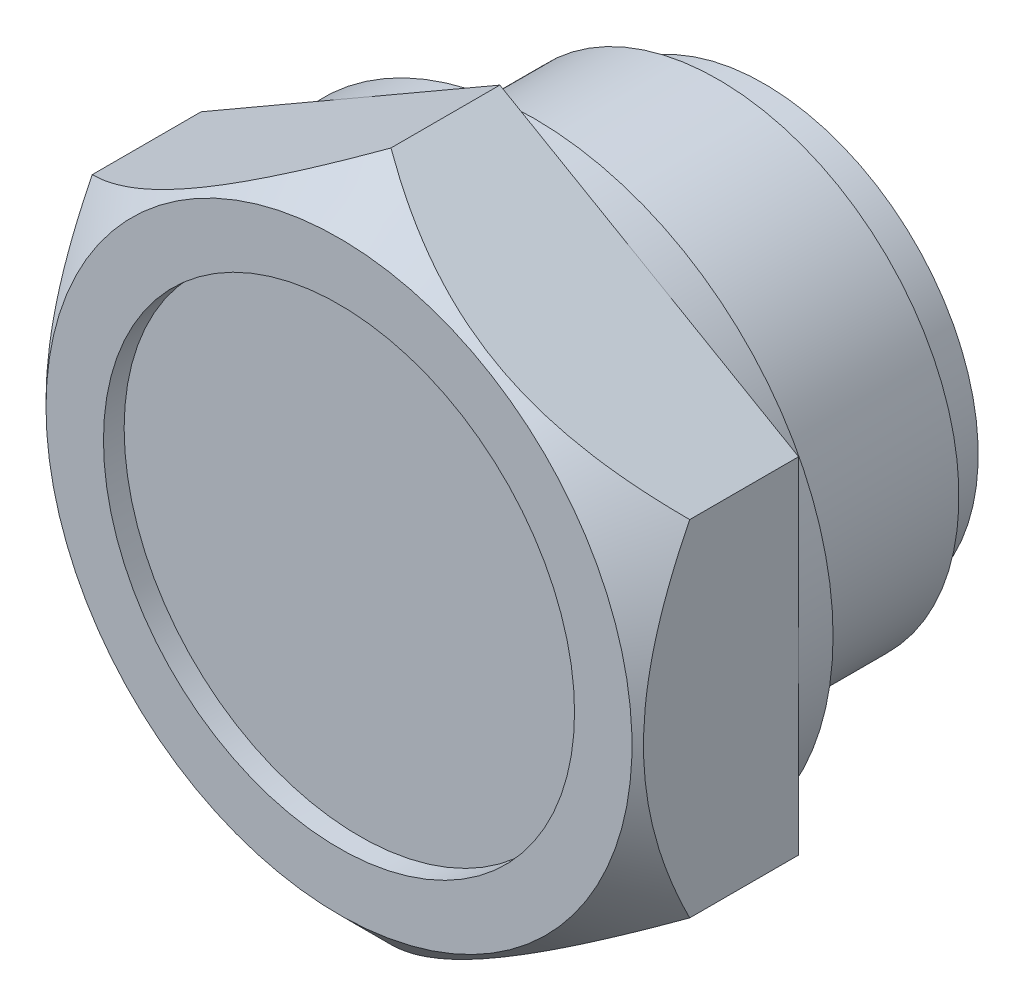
ISO-10303-21;
HEADER;
FILE_DESCRIPTION(('STEP AP214'),'2;1');
FILE_NAME('part.step','',(''),(''),'','','');
FILE_SCHEMA(('AUTOMOTIVE_DESIGN { 1 0 10303 214 1 1 1 1 }'));
ENDSEC;
DATA;
#1=APPLICATION_CONTEXT('core data for automotive mechanical design processes');
#2=APPLICATION_PROTOCOL_DEFINITION('international standard','automotive_design',2000,#1);
#3=PRODUCT_CONTEXT('',#1,'mechanical');
#4=PRODUCT('Part','Part','',(#3));
#5=PRODUCT_RELATED_PRODUCT_CATEGORY('part','',(#4));
#6=PRODUCT_DEFINITION_FORMATION('','',#4);
#7=PRODUCT_DEFINITION_CONTEXT('part definition',#1,'design');
#8=PRODUCT_DEFINITION('design','',#6,#7);
#9=PRODUCT_DEFINITION_SHAPE('','',#8);
#10=(LENGTH_UNIT() NAMED_UNIT(*) SI_UNIT(.MILLI.,.METRE.));
#11=(NAMED_UNIT(*) PLANE_ANGLE_UNIT() SI_UNIT($,.RADIAN.));
#12=(NAMED_UNIT(*) SI_UNIT($,.STERADIAN.) SOLID_ANGLE_UNIT());
#13=UNCERTAINTY_MEASURE_WITH_UNIT(LENGTH_MEASURE(1.E-05),#10,'distance_accuracy_value','');
#14=(GEOMETRIC_REPRESENTATION_CONTEXT(3) GLOBAL_UNCERTAINTY_ASSIGNED_CONTEXT((#13)) GLOBAL_UNIT_ASSIGNED_CONTEXT((#10,
#11,#12)) REPRESENTATION_CONTEXT('',''));
#15=CARTESIAN_POINT('',(0.,0.,0.));
#16=DIRECTION('',(0.,0.,1.));
#17=DIRECTION('',(1.,0.,0.));
#18=AXIS2_PLACEMENT_3D('',#15,#16,#17);
#19=CARTESIAN_POINT('',(0.,13.,1.5));
#20=DIRECTION('',(0.,0.,-1.));
#21=DIRECTION('',(-1.,0.,0.));
#22=AXIS2_PLACEMENT_3D('',#19,#20,#21);
#23=PLANE('',#22);
#24=DIRECTION('',(7.05455965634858E-10,1.,0.));
#25=VECTOR('',#24,1.);
#26=CARTESIAN_POINT('',(13.0000000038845,12.9999999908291,1.5));
#27=LINE('',#26,#25);
#28=CARTESIAN_POINT('',(12.999999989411,-7.5055534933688,1.5));
#29=VERTEX_POINT('',#28);
#30=CARTESIAN_POINT('',(13.,-9.17091402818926E-09,1.5));
#31=VERTEX_POINT('',#30);
#32=EDGE_CURVE('E311',#29,#31,#27,.T.);
#33=ORIENTED_EDGE('',*,*,#32,.F.);
#34=DIRECTION('',(0.866025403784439,0.5,0.));
#35=VECTOR('',#34,1.);
#36=CARTESIAN_POINT('',(12.1291651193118,-8.00833024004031,1.5));
#37=LINE('',#36,#35);
#38=CARTESIAN_POINT('',(6.5,-11.2583302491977,1.5));
#39=VERTEX_POINT('',#38);
#40=EDGE_CURVE('E313',#39,#29,#37,.T.);
#41=ORIENTED_EDGE('',*,*,#40,.F.);
#42=CARTESIAN_POINT('',(0.,0.,1.5));
#43=DIRECTION('',(0.,0.,-1.));
#44=DIRECTION('',(-1.,0.,0.));
#45=AXIS2_PLACEMENT_3D('',#42,#43,#44);
#46=CIRCLE('',#45,13.);
#47=EDGE_CURVE('E319',#31,#39,#46,.T.);
#48=ORIENTED_EDGE('',*,*,#47,.F.);
#49=EDGE_LOOP('',(#33,#41,#48));
#50=FACE_BOUND('',#49,.T.);
#51=ADVANCED_FACE('F14',(#50),#23,.T.);
#52=CARTESIAN_POINT('',(13.0000000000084,7.5055534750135,1.5));
#53=VERTEX_POINT('',#52);
#54=EDGE_CURVE('E310',#31,#53,#27,.T.);
#55=ORIENTED_EDGE('',*,*,#54,.F.);
#56=CARTESIAN_POINT('',(6.5,11.2583302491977,1.5));
#57=VERTEX_POINT('',#56);
#58=EDGE_CURVE('E266',#57,#31,#46,.T.);
#59=ORIENTED_EDGE('',*,*,#58,.F.);
#60=DIRECTION('',(-0.866025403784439,0.5,0.));
#61=VECTOR('',#60,1.);
#62=CARTESIAN_POINT('',(0.870834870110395,14.5083302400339,1.5));
#63=LINE('',#62,#61);
#64=EDGE_CURVE('E200',#53,#57,#63,.T.);
#65=ORIENTED_EDGE('',*,*,#64,.F.);
#66=EDGE_LOOP('',(#55,#59,#65));
#67=FACE_BOUND('',#66,.T.);
#68=ADVANCED_FACE('F236',(#67),#23,.T.);
#69=CARTESIAN_POINT('',(0.,15.0111069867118,1.5));
#70=VERTEX_POINT('',#69);
#71=EDGE_CURVE('E201',#57,#70,#63,.T.);
#72=ORIENTED_EDGE('',*,*,#71,.F.);
#73=CARTESIAN_POINT('',(-6.5,11.2583302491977,1.5));
#74=VERTEX_POINT('',#73);
#75=EDGE_CURVE('E261',#74,#57,#46,.T.);
#76=ORIENTED_EDGE('',*,*,#75,.F.);
#77=DIRECTION('',(-0.866025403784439,-0.5,0.));
#78=VECTOR('',#77,1.);
#79=CARTESIAN_POINT('',(-0.870834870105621,14.5083302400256,1.5));
#80=LINE('',#79,#78);
#81=EDGE_CURVE('E258',#70,#74,#80,.T.);
#82=ORIENTED_EDGE('',*,*,#81,.F.);
#83=EDGE_LOOP('',(#72,#76,#82));
#84=FACE_BOUND('',#83,.T.);
#85=ADVANCED_FACE('F241',(#84),#23,.T.);
#86=CARTESIAN_POINT('',(1.05861500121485E-11,-15.0111069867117,1.5));
#87=VERTEX_POINT('',#86);
#88=EDGE_CURVE('E39',#87,#39,#37,.T.);
#89=ORIENTED_EDGE('',*,*,#88,.F.);
#90=DIRECTION('',(0.866025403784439,-0.5,0.));
#91=VECTOR('',#90,1.);
#92=CARTESIAN_POINT('',(-12.1291651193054,-8.00833024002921,1.5));
#93=LINE('',#92,#91);
#94=CARTESIAN_POINT('',(-6.5,-11.2583302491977,1.5));
#95=VERTEX_POINT('',#94);
#96=EDGE_CURVE('E115',#95,#87,#93,.T.);
#97=ORIENTED_EDGE('',*,*,#96,.F.);
#98=EDGE_CURVE('E320',#39,#95,#46,.T.);
#99=ORIENTED_EDGE('',*,*,#98,.F.);
#100=EDGE_LOOP('',(#89,#97,#99));
#101=FACE_BOUND('',#100,.T.);
#102=ADVANCED_FACE('F248',(#101),#23,.T.);
#103=CARTESIAN_POINT('',(-12.9999999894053,7.5055534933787,1.5));
#104=VERTEX_POINT('',#103);
#105=EDGE_CURVE('E199',#74,#104,#80,.T.);
#106=ORIENTED_EDGE('',*,*,#105,.F.);
#107=CARTESIAN_POINT('',(-13.,0.,1.5));
#108=VERTEX_POINT('',#107);
#109=EDGE_CURVE('E23',#108,#74,#46,.T.);
#110=ORIENTED_EDGE('',*,*,#109,.F.);
#111=DIRECTION('',(0.,-1.,0.));
#112=VECTOR('',#111,1.);
#113=CARTESIAN_POINT('',(-12.9999999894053,13.,1.5));
#114=LINE('',#113,#112);
#115=EDGE_CURVE('E120',#104,#108,#114,.T.);
#116=ORIENTED_EDGE('',*,*,#115,.F.);
#117=EDGE_LOOP('',(#106,#110,#116));
#118=FACE_BOUND('',#117,.T.);
#119=ADVANCED_FACE('F244',(#118),#23,.T.);
#120=CARTESIAN_POINT('',(-12.9999999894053,-7.5055534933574,1.5));
#121=VERTEX_POINT('',#120);
#122=EDGE_CURVE('E107',#121,#95,#93,.T.);
#123=ORIENTED_EDGE('',*,*,#122,.F.);
#124=EDGE_CURVE('E109',#108,#121,#114,.T.);
#125=ORIENTED_EDGE('',*,*,#124,.F.);
#126=EDGE_CURVE('E111',#95,#108,#46,.T.);
#127=ORIENTED_EDGE('',*,*,#126,.F.);
#128=EDGE_LOOP('',(#123,#125,#127));
#129=FACE_BOUND('',#128,.T.);
#130=ADVANCED_FACE('F108',(#129),#23,.T.);
#131=CARTESIAN_POINT('',(0.,0.,-10.));
#132=DIRECTION('',(0.,0.,-1.));
#133=DIRECTION('',(-1.,0.,0.));
#134=AXIS2_PLACEMENT_3D('',#131,#132,#133);
#135=PLANE('',#134);
#136=CARTESIAN_POINT('',(0.,0.,-10.));
#137=DIRECTION('',(0.,0.,-1.));
#138=DIRECTION('',(-1.,0.,0.));
#139=AXIS2_PLACEMENT_3D('',#136,#137,#138);
#140=CIRCLE('',#139,9.3155000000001);
#141=CARTESIAN_POINT('',(-9.3155000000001,0.,-10.));
#142=VERTEX_POINT('',#141);
#143=EDGE_CURVE('E271',#142,#142,#140,.T.);
#144=ORIENTED_EDGE('',*,*,#143,.T.);
#145=EDGE_LOOP('',(#144));
#146=FACE_BOUND('',#145,.T.);
#147=ADVANCED_FACE('F16',(#146),#135,.T.);
#148=CARTESIAN_POINT('',(0.,0.,-12.4498016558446));
#149=DIRECTION('',(0.,0.,-1.));
#150=DIRECTION('',(-1.,0.,0.));
#151=AXIS2_PLACEMENT_3D('',#148,#149,#150);
#152=CYLINDRICAL_SURFACE('',#151,13.);
#153=ORIENTED_EDGE('',*,*,#109,.T.);
#154=ORIENTED_EDGE('',*,*,#75,.T.);
#155=ORIENTED_EDGE('',*,*,#58,.T.);
#156=ORIENTED_EDGE('',*,*,#47,.T.);
#157=ORIENTED_EDGE('',*,*,#98,.T.);
#158=ORIENTED_EDGE('',*,*,#126,.T.);
#159=EDGE_LOOP('',(#153,#154,#155,#156,#157,#158));
#160=FACE_BOUND('',#159,.T.);
#161=CARTESIAN_POINT('',(0.,0.,0.));
#162=DIRECTION('',(0.,0.,-1.));
#163=DIRECTION('',(-1.,0.,0.));
#164=AXIS2_PLACEMENT_3D('',#161,#162,#163);
#165=CIRCLE('',#164,13.);
#166=CARTESIAN_POINT('',(-6.49999999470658,-11.2583302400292,0.));
#167=VERTEX_POINT('',#166);
#168=CARTESIAN_POINT('',(-12.9999999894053,0.,0.));
#169=VERTEX_POINT('',#168);
#170=EDGE_CURVE('E332',#167,#169,#165,.T.);
#171=ORIENTED_EDGE('',*,*,#170,.F.);
#172=CARTESIAN_POINT('',(0.,0.,0.));
#173=DIRECTION('',(0.,0.,-1.));
#174=DIRECTION('',(-1.,0.,0.));
#175=AXIS2_PLACEMENT_3D('',#172,#173,#174);
#176=CIRCLE('',#175,13.);
#177=CARTESIAN_POINT('',(6.49999999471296,-11.2583302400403,0.));
#178=VERTEX_POINT('',#177);
#179=EDGE_CURVE('E18',#178,#167,#176,.T.);
#180=ORIENTED_EDGE('',*,*,#179,.F.);
#181=CARTESIAN_POINT('',(12.9999999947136,-9.17091402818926E-09,0.));
#182=VERTEX_POINT('',#181);
#183=EDGE_CURVE('E322',#182,#178,#165,.T.);
#184=ORIENTED_EDGE('',*,*,#183,.F.);
#185=CARTESIAN_POINT('',(0.,0.,0.));
#186=DIRECTION('',(0.,0.,-1.));
#187=DIRECTION('',(-1.,0.,0.));
#188=AXIS2_PLACEMENT_3D('',#185,#186,#187);
#189=CIRCLE('',#188,13.);
#190=CARTESIAN_POINT('',(6.49999999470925,11.2583302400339,0.));
#191=VERTEX_POINT('',#190);
#192=EDGE_CURVE('E328',#191,#182,#189,.T.);
#193=ORIENTED_EDGE('',*,*,#192,.F.);
#194=CARTESIAN_POINT('',(-6.49999999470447,11.2583302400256,0.));
#195=VERTEX_POINT('',#194);
#196=EDGE_CURVE('E327',#195,#191,#165,.T.);
#197=ORIENTED_EDGE('',*,*,#196,.F.);
#198=CARTESIAN_POINT('',(0.,0.,0.));
#199=DIRECTION('',(0.,0.,-1.));
#200=DIRECTION('',(-1.,0.,0.));
#201=AXIS2_PLACEMENT_3D('',#198,#199,#200);
#202=CIRCLE('',#201,13.);
#203=EDGE_CURVE('E325',#169,#195,#202,.T.);
#204=ORIENTED_EDGE('',*,*,#203,.F.);
#205=EDGE_LOOP('',(#171,#180,#184,#193,#197,#204));
#206=FACE_BOUND('',#205,.T.);
#207=ADVANCED_FACE('F224',(#160,#206),#152,.T.);
#208=CARTESIAN_POINT('',(0.,10.4775,0.));
#209=DIRECTION('',(0.,0.,-1.));
#210=DIRECTION('',(-1.,0.,0.));
#211=AXIS2_PLACEMENT_3D('',#208,#209,#210);
#212=PLANE('',#211);
#213=ORIENTED_EDGE('',*,*,#203,.T.);
#214=ORIENTED_EDGE('',*,*,#196,.T.);
#215=ORIENTED_EDGE('',*,*,#192,.T.);
#216=ORIENTED_EDGE('',*,*,#183,.T.);
#217=ORIENTED_EDGE('',*,*,#179,.T.);
#218=ORIENTED_EDGE('',*,*,#170,.T.);
#219=EDGE_LOOP('',(#213,#214,#215,#216,#217,#218));
#220=FACE_BOUND('',#219,.T.);
#221=CARTESIAN_POINT('',(0.,0.,0.));
#222=DIRECTION('',(0.,0.,-1.));
#223=DIRECTION('',(-1.,0.,0.));
#224=AXIS2_PLACEMENT_3D('',#221,#222,#223);
#225=CIRCLE('',#224,10.4775);
#226=CARTESIAN_POINT('',(-10.4775,0.,0.));
#227=VERTEX_POINT('',#226);
#228=EDGE_CURVE('E334',#227,#227,#225,.T.);
#229=ORIENTED_EDGE('',*,*,#228,.F.);
#230=EDGE_LOOP('',(#229));
#231=FACE_BOUND('',#230,.T.);
#232=ADVANCED_FACE('F221',(#220,#231),#212,.T.);
#233=CARTESIAN_POINT('',(0.,0.,-12.4498016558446));
#234=DIRECTION('',(0.,0.,-1.));
#235=DIRECTION('',(-1.,0.,0.));
#236=AXIS2_PLACEMENT_3D('',#233,#234,#235);
#237=CYLINDRICAL_SURFACE('',#236,10.4775);
#238=CARTESIAN_POINT('',(0.,0.,-8.));
#239=DIRECTION('',(0.,0.,-1.));
#240=DIRECTION('',(-1.,0.,0.));
#241=AXIS2_PLACEMENT_3D('',#238,#239,#240);
#242=CIRCLE('',#241,10.4775);
#243=CARTESIAN_POINT('',(-10.4775,0.,-8.));
#244=VERTEX_POINT('',#243);
#245=EDGE_CURVE('E337',#244,#244,#242,.T.);
#246=ORIENTED_EDGE('',*,*,#245,.F.);
#247=EDGE_LOOP('',(#246));
#248=FACE_BOUND('',#247,.T.);
#249=ORIENTED_EDGE('',*,*,#228,.T.);
#250=EDGE_LOOP('',(#249));
#251=FACE_BOUND('',#250,.T.);
#252=ADVANCED_FACE('F217',(#248,#251),#237,.T.);
#253=CARTESIAN_POINT('',(0.,9.3155,-8.));
#254=DIRECTION('',(0.,0.,-1.));
#255=DIRECTION('',(-1.,0.,0.));
#256=AXIS2_PLACEMENT_3D('',#253,#254,#255);
#257=PLANE('',#256);
#258=ORIENTED_EDGE('',*,*,#245,.T.);
#259=EDGE_LOOP('',(#258));
#260=FACE_BOUND('',#259,.T.);
#261=CARTESIAN_POINT('',(0.,0.,-8.));
#262=DIRECTION('',(0.,0.,-1.));
#263=DIRECTION('',(-1.,0.,0.));
#264=AXIS2_PLACEMENT_3D('',#261,#262,#263);
#265=CIRCLE('',#264,9.3155000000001);
#266=CARTESIAN_POINT('',(-9.3155000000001,0.,-8.));
#267=VERTEX_POINT('',#266);
#268=EDGE_CURVE('E274',#267,#267,#265,.T.);
#269=ORIENTED_EDGE('',*,*,#268,.F.);
#270=EDGE_LOOP('',(#269));
#271=FACE_BOUND('',#270,.T.);
#272=ADVANCED_FACE('F213',(#260,#271),#257,.T.);
#273=CARTESIAN_POINT('',(0.,0.,-12.4498016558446));
#274=DIRECTION('',(0.,0.,-1.));
#275=DIRECTION('',(-1.,0.,0.));
#276=AXIS2_PLACEMENT_3D('',#273,#274,#275);
#277=CYLINDRICAL_SURFACE('',#276,9.3155000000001);
#278=ORIENTED_EDGE('',*,*,#143,.F.);
#279=EDGE_LOOP('',(#278));
#280=FACE_BOUND('',#279,.T.);
#281=ORIENTED_EDGE('',*,*,#268,.T.);
#282=EDGE_LOOP('',(#281));
#283=FACE_BOUND('',#282,.T.);
#284=ADVANCED_FACE('F210',(#280,#283),#277,.T.);
#285=CARTESIAN_POINT('',(-12.9999999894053,7.50555349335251,-10.));
#286=DIRECTION('',(0.5,-0.866025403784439,0.));
#287=DIRECTION('',(-0.866025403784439,-0.5,0.));
#288=AXIS2_PLACEMENT_3D('',#285,#286,#287);
#289=PLANE('',#288);
#290=CARTESIAN_POINT('',(0.000200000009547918,15.0112224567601,6.23877753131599));
#291=CARTESIAN_POINT('',(-0.223298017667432,14.882185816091,6.36779487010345));
#292=CARTESIAN_POINT('',(-0.44854637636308,14.7521386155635,6.4928752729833));
#293=CARTESIAN_POINT('',(-0.902816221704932,14.4898657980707,6.73391164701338));
#294=CARTESIAN_POINT('',(-1.13183968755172,14.3576390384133,6.8498626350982));
#295=CARTESIAN_POINT('',(-1.59501238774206,14.0902261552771,7.07188066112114));
#296=CARTESIAN_POINT('',(-1.8291834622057,13.9550274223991,7.17788730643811));
#297=CARTESIAN_POINT('',(-2.30137174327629,13.6824093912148,7.37771430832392));
#298=CARTESIAN_POINT('',(-2.53938835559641,13.5449904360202,7.4715365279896));
#299=CARTESIAN_POINT('',(-3.01544085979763,13.2701413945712,7.64402617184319));
#300=CARTESIAN_POINT('',(-3.25341825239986,13.1327450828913,7.72290762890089));
#301=CARTESIAN_POINT('',(-3.73270900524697,12.8560264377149,7.86571521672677));
#302=CARTESIAN_POINT('',(-3.974022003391,12.7167043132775,7.9296429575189));
#303=CARTESIAN_POINT('',(-4.45895181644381,12.4367299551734,8.04093368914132));
#304=CARTESIAN_POINT('',(-4.70256215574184,12.2960814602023,8.08833396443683));
#305=CARTESIAN_POINT('',(-5.19182797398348,12.0136037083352,8.16552822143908));
#306=CARTESIAN_POINT('',(-5.43748314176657,11.8717746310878,8.19532483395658));
#307=CARTESIAN_POINT('',(-6.03612690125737,11.5261474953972,8.24528552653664));
#308=CARTESIAN_POINT('',(-6.38976254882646,11.3219758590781,8.25576953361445));
#309=CARTESIAN_POINT('',(-7.09639423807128,10.9140018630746,8.23817095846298));
#310=CARTESIAN_POINT('',(-7.44939001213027,10.7101996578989,8.21007485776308));
#311=CARTESIAN_POINT('',(-8.15205400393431,10.304516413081,8.11697445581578));
#312=CARTESIAN_POINT('',(-8.50171805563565,10.1026377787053,8.0519288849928));
#313=CARTESIAN_POINT('',(-9.19503609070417,9.70235042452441,7.88846520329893));
#314=CARTESIAN_POINT('',(-9.53869053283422,9.50394143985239,7.7900496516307));
#315=CARTESIAN_POINT('',(-10.1487167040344,9.15174266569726,7.58758644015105));
#316=CARTESIAN_POINT('',(-10.4164396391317,8.99717275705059,7.48886508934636));
#317=CARTESIAN_POINT('',(-10.9470799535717,8.69080742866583,7.27551496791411));
#318=CARTESIAN_POINT('',(-11.2099971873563,8.53901209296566,7.16088571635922));
#319=CARTESIAN_POINT('',(-11.7301979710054,8.23867403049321,6.91828905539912));
#320=CARTESIAN_POINT('',(-11.9874963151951,8.09012276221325,6.79036359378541));
#321=CARTESIAN_POINT('',(-12.4973289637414,7.79577074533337,6.52285374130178));
#322=CARTESIAN_POINT('',(-12.7498660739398,7.64996837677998,6.38327649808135));
#323=CARTESIAN_POINT('',(-13.0001999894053,7.5054380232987,6.2387775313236));
#324=B_SPLINE_CURVE_WITH_KNOTS('',3,(#290,#291,#292,#293,#294,#295,#296,#297,#298,#299,#300,
#301,#302,#303,#304,#305,#306,#307,#308,#309,#310,#311,#312,#313,#314,#315,#316,#317,#318,#319,
#320,#321,#322,#323),.UNSPECIFIED.,.F.,.F.,(4,2,2,2,2,2,2,2,2,2,2,2,2,2,2,2,4),(0.,
0.86561485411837,1.73169895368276,2.6027418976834,3.47365149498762,4.33094279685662,
5.18814175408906,6.04339424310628,6.89851888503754,8.12204249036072,9.34599492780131,
10.5713171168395,11.7965453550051,12.7696491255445,13.7427823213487,14.712933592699,
15.6824940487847),.UNSPECIFIED.);
#325=CARTESIAN_POINT('',(9.54791801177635E-12,15.0111069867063,6.23889300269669));
#326=VERTEX_POINT('',#325);
#327=CARTESIAN_POINT('',(-12.9999999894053,7.50555349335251,6.23889300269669));
#328=VERTEX_POINT('',#327);
#329=EDGE_CURVE('E269',#326,#328,#324,.T.);
#330=ORIENTED_EDGE('',*,*,#329,.F.);
#331=DIRECTION('',(0.,0.,1.));
#332=VECTOR('',#331,1.);
#333=CARTESIAN_POINT('',(9.54791801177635E-12,15.0111069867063,-10.));
#334=LINE('',#333,#332);
#335=EDGE_CURVE('E121',#70,#326,#334,.T.);
#336=ORIENTED_EDGE('',*,*,#335,.F.);
#337=ORIENTED_EDGE('',*,*,#81,.T.);
#338=ORIENTED_EDGE('',*,*,#105,.T.);
#339=DIRECTION('',(0.,0.,1.));
#340=VECTOR('',#339,1.);
#341=CARTESIAN_POINT('',(-12.9999999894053,7.50555349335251,-10.));
#342=LINE('',#341,#340);
#343=EDGE_CURVE('E128',#104,#328,#342,.T.);
#344=ORIENTED_EDGE('',*,*,#343,.T.);
#345=EDGE_LOOP('',(#330,#336,#337,#338,#344));
#346=FACE_BOUND('',#345,.T.);
#347=ADVANCED_FACE('F207',(#346),#289,.F.);
#348=CARTESIAN_POINT('',(9.54791801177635E-12,15.0111069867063,-10.));
#349=DIRECTION('',(-0.5,-0.866025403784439,0.));
#350=DIRECTION('',(-0.866025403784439,0.5,0.));
#351=AXIS2_PLACEMENT_3D('',#348,#349,#350);
#352=PLANE('',#351);
#353=CARTESIAN_POINT('',(13.0002000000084,7.505438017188,6.23877752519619));
#354=CARTESIAN_POINT('',(12.7767019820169,7.63447465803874,6.36779486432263));
#355=CARTESIAN_POINT('',(12.5514536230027,7.76452185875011,6.49287526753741));
#356=CARTESIAN_POINT('',(12.0971837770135,8.02679467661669,6.73391164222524));
#357=CARTESIAN_POINT('',(11.8681603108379,8.15902143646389,6.84986263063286));
#358=CARTESIAN_POINT('',(11.4049876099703,8.4264343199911,7.0718806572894));
#359=CARTESIAN_POINT('',(11.170816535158,8.56163305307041,7.17788730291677));
#360=CARTESIAN_POINT('',(10.6986282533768,8.83425108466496,7.37771430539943));
#361=CARTESIAN_POINT('',(10.4606116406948,8.97167004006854,7.47153652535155));
#362=CARTESIAN_POINT('',(9.98455913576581,9.24651908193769,7.64402616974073));
#363=CARTESIAN_POINT('',(9.74658174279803,9.38391539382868,7.72290762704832));
#364=CARTESIAN_POINT('',(9.26729098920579,9.66063403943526,7.86571521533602));
#365=CARTESIAN_POINT('',(9.02597799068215,9.79995616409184,7.92964295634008));
#366=CARTESIAN_POINT('',(8.54104817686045,10.0799305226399,8.04093368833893));
#367=CARTESIAN_POINT('',(8.2974378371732,10.2205790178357,8.08833396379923));
#368=CARTESIAN_POINT('',(7.80817201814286,10.5030567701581,8.16552822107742));
#369=CARTESIAN_POINT('',(7.56251684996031,10.6448858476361,8.1953248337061));
#370=CARTESIAN_POINT('',(6.96387309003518,10.9905129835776,8.2452855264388));
#371=CARTESIAN_POINT('',(6.61023744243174,11.1946846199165,8.25576953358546));
#372=CARTESIAN_POINT('',(5.90360575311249,11.6026586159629,8.23817095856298));
#373=CARTESIAN_POINT('',(5.55060997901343,11.8064608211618,8.21007485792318));
#374=CARTESIAN_POINT('',(4.84794598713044,12.2121440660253,8.11697445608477));
#375=CARTESIAN_POINT('',(4.49828193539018,12.4140227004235,8.05192888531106));
#376=CARTESIAN_POINT('',(3.80496390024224,12.8143100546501,7.88846520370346));
#377=CARTESIAN_POINT('',(3.4613094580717,13.0127190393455,7.79004965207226));
#378=CARTESIAN_POINT('',(2.85128328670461,13.364917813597,7.58758644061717));
#379=CARTESIAN_POINT('',(2.58356035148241,13.5194877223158,7.48886508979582));
#380=CARTESIAN_POINT('',(2.05292003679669,13.8258530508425,7.27551496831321));
#381=CARTESIAN_POINT('',(1.79000280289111,13.9776483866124,7.1608857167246));
#382=CARTESIAN_POINT('',(1.26980201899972,14.2779864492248,6.91828905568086));
#383=CARTESIAN_POINT('',(1.01250367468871,14.4265377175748,6.79036359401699));
#384=CARTESIAN_POINT('',(0.502671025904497,14.720889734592,6.52285374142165));
#385=CARTESIAN_POINT('',(0.250133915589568,14.8666921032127,6.38327649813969));
#386=CARTESIAN_POINT('',(-0.000199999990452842,15.0112224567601,6.23877753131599));
#387=B_SPLINE_CURVE_WITH_KNOTS('',3,(#353,#354,#355,#356,#357,#358,#359,#360,#361,#362,#363,
#364,#365,#366,#367,#368,#369,#370,#371,#372,#373,#374,#375,#376,#377,#378,#379,#380,#381,#382,
#383,#384,#385,#386),.UNSPECIFIED.,.F.,.F.,(4,2,2,2,2,2,2,2,2,2,2,2,2,2,2,2,4),(0.,
0.865614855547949,1.73169895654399,2.6027419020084,3.47365150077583,4.33094280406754,
5.18814176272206,6.04339425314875,6.89851889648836,8.12204250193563,9.34599493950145,
10.5713171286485,11.7965453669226,12.7696491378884,13.7427823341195,14.7129336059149,
15.6824940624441),.UNSPECIFIED.);
#388=CARTESIAN_POINT('',(13.0000000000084,7.5055534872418,6.23889300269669));
#389=VERTEX_POINT('',#388);
#390=EDGE_CURVE('E191',#389,#326,#387,.T.);
#391=ORIENTED_EDGE('',*,*,#390,.F.);
#392=DIRECTION('',(0.,0.,1.));
#393=VECTOR('',#392,1.);
#394=CARTESIAN_POINT('',(13.0000000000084,7.5055534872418,-10.));
#395=LINE('',#394,#393);
#396=EDGE_CURVE('E139',#53,#389,#395,.T.);
#397=ORIENTED_EDGE('',*,*,#396,.F.);
#398=ORIENTED_EDGE('',*,*,#64,.T.);
#399=ORIENTED_EDGE('',*,*,#71,.T.);
#400=ORIENTED_EDGE('',*,*,#335,.T.);
#401=EDGE_LOOP('',(#391,#397,#398,#399,#400));
#402=FACE_BOUND('',#401,.T.);
#403=ADVANCED_FACE('F202',(#402),#352,.F.);
#404=CARTESIAN_POINT('',(13.0000000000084,7.5055534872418,-10.));
#405=DIRECTION('',(-1.,7.05455965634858E-10,0.));
#406=DIRECTION('',(7.05455965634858E-10,1.,0.));
#407=AXIS2_PLACEMENT_3D('',#404,#405,#406);
#408=PLANE('',#407);
#409=CARTESIAN_POINT('',(12.9999999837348,-15.5627345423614,0.971964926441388));
#410=CARTESIAN_POINT('',(12.9999999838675,-15.374555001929,1.11638415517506));
#411=CARTESIAN_POINT('',(12.9999999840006,-15.185858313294,1.26012902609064));
#412=CARTESIAN_POINT('',(12.9999999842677,-14.8073437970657,1.5461413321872));
#413=CARTESIAN_POINT('',(12.9999999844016,-14.6175259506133,1.68840874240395));
#414=CARTESIAN_POINT('',(12.9999999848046,-14.046185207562,2.11285737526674));
#415=CARTESIAN_POINT('',(12.999999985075,-13.6628587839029,2.39262060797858));
#416=CARTESIAN_POINT('',(12.9999999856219,-12.8876629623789,2.94651018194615));
#417=CARTESIAN_POINT('',(12.9999999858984,-12.4957504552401,3.22057632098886));
#418=CARTESIAN_POINT('',(12.999999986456,-11.705384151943,3.75907857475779));
#419=CARTESIAN_POINT('',(12.999999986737,-11.3069308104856,4.02351535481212));
#420=CARTESIAN_POINT('',(12.9999999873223,-10.4772497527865,4.55672428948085));
#421=CARTESIAN_POINT('',(12.9999999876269,-10.0455299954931,4.82473461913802));
#422=CARTESIAN_POINT('',(12.9999999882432,-9.17195865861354,5.34398222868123));
#423=CARTESIAN_POINT('',(12.9999999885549,-8.73010540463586,5.59521670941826));
#424=CARTESIAN_POINT('',(12.9999999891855,-7.83617164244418,6.07555147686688));
#425=CARTESIAN_POINT('',(12.9999999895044,-7.38412633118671,6.30471676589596));
#426=CARTESIAN_POINT('',(12.9999999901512,-6.46731246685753,6.73577955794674));
#427=CARTESIAN_POINT('',(12.999999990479,-6.00255000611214,6.9376898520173));
#428=CARTESIAN_POINT('',(12.9999999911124,-5.10472263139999,7.28918244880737));
#429=CARTESIAN_POINT('',(12.999999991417,-4.67290704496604,7.44192955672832));
#430=CARTESIAN_POINT('',(12.9999999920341,-3.7982771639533,7.71285217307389));
#431=CARTESIAN_POINT('',(12.9999999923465,-3.35546216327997,7.83102545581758));
#432=CARTESIAN_POINT('',(12.9999999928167,-2.68881051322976,7.9765777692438));
#433=CARTESIAN_POINT('',(12.9999999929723,-2.46831573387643,8.01954482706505));
#434=CARTESIAN_POINT('',(12.9999999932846,-2.02554340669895,8.09495213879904));
#435=CARTESIAN_POINT('',(12.9999999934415,-1.80326610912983,8.12739384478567));
#436=CARTESIAN_POINT('',(12.999999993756,-1.35739034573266,8.18120012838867));
#437=CARTESIAN_POINT('',(12.9999999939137,-1.13379199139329,8.20256562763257));
#438=CARTESIAN_POINT('',(12.9999999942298,-0.685792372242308,8.23384122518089));
#439=CARTESIAN_POINT('',(12.9999999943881,-0.461391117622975,8.24375146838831));
#440=CARTESIAN_POINT('',(12.9999999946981,-0.0219459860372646,8.25175806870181));
#441=CARTESIAN_POINT('',(12.9999999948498,0.193089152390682,8.25033985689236));
#442=CARTESIAN_POINT('',(12.999999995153,0.622847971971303,8.23686033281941));
#443=CARTESIAN_POINT('',(12.9999999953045,0.837571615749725,8.22479783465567));
#444=CARTESIAN_POINT('',(12.9999999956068,1.26616345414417,8.19023136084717));
#445=CARTESIAN_POINT('',(12.9999999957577,1.48003169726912,8.16772798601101));
#446=CARTESIAN_POINT('',(12.9999999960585,1.90647757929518,8.11265253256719));
#447=CARTESIAN_POINT('',(12.9999999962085,2.11905504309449,8.08007911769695));
#448=CARTESIAN_POINT('',(12.9999999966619,2.76179001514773,7.9666343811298));
#449=CARTESIAN_POINT('',(12.9999999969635,3.18935113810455,7.87067449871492));
#450=CARTESIAN_POINT('',(12.9999999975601,4.03499608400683,7.64430755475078));
#451=CARTESIAN_POINT('',(12.999999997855,4.45308048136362,7.51390258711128));
#452=CARTESIAN_POINT('',(12.999999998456,5.30489689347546,7.2152938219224));
#453=CARTESIAN_POINT('',(12.9999999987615,5.73797320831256,7.04523667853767));
#454=CARTESIAN_POINT('',(12.9999999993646,6.59296720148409,6.67886902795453));
#455=CARTESIAN_POINT('',(12.9999999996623,7.01487972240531,6.48254663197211));
#456=CARTESIAN_POINT('',(13.0000000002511,7.84955514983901,6.06830606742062));
#457=CARTESIAN_POINT('',(13.0000000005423,8.26228469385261,5.85032120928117));
#458=CARTESIAN_POINT('',(13.0000000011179,9.07828093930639,5.39755537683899));
#459=CARTESIAN_POINT('',(13.0000000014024,9.4815490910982,5.16277699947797));
#460=CARTESIAN_POINT('',(13.0000000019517,10.260137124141,4.69164251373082));
#461=CARTESIAN_POINT('',(13.0000000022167,10.6358532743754,4.45593782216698));
#462=CARTESIAN_POINT('',(13.0000000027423,11.3808309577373,3.97450999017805));
#463=CARTESIAN_POINT('',(13.0000000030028,11.7500920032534,3.72878609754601));
#464=CARTESIAN_POINT('',(13.0000000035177,12.4800318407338,3.23111118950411));
#465=CARTESIAN_POINT('',(13.0000000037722,12.8407557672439,2.97922613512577));
#466=CARTESIAN_POINT('',(13.0000000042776,13.5572571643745,2.46871470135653));
#467=CARTESIAN_POINT('',(13.0000000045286,13.9130359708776,2.21009019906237));
#468=CARTESIAN_POINT('',(13.0000000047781,14.2667408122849,1.9487074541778));
#469=B_SPLINE_CURVE_WITH_KNOTS('',3,(#409,#410,#411,#412,#413,#414,#415,#416,#417,#418,#419,
#420,#421,#422,#423,#424,#425,#426,#427,#428,#429,#430,#431,#432,#433,#434,#435,#436,#437,#438,
#439,#440,#441,#442,#443,#444,#445,#446,#447,#448,#449,#450,#451,#452,#453,#454,#455,#456,#457,
#458,#459,#460,#461,#462,#463,#464,#465,#466,#467,#468),.UNSPECIFIED.,.F.,.F.,(4,2,2,2,2,2,2,2,
2,2,2,2,2,2,2,2,2,2,2,2,2,2,2,2,2,2,2,2,2,4),(0.,0.71162635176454,1.42326470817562,
2.84685813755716,4.28144341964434,5.71592939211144,7.2400622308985,8.76444874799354,
10.2841984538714,11.8032324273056,13.1762007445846,14.5492574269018,15.2229730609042,
15.8965957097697,16.5701622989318,17.2437203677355,17.8885760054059,18.5335034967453,
19.1783938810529,19.8233698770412,21.1361088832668,22.4487681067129,23.8434876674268,
25.2388406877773,26.6386309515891,28.03820521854,29.3686104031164,30.6991156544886,
32.0189222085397,33.338365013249),.UNSPECIFIED.);
#470=CARTESIAN_POINT('',(12.9999999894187,-7.50555349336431,6.23889300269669));
#471=VERTEX_POINT('',#470);
#472=EDGE_CURVE('E183',#471,#389,#469,.T.);
#473=ORIENTED_EDGE('',*,*,#472,.F.);
#474=DIRECTION('',(0.,0.,1.));
#475=VECTOR('',#474,1.);
#476=CARTESIAN_POINT('',(12.9999999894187,-7.50555349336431,-10.));
#477=LINE('',#476,#475);
#478=EDGE_CURVE('E130',#29,#471,#477,.T.);
#479=ORIENTED_EDGE('',*,*,#478,.F.);
#480=ORIENTED_EDGE('',*,*,#32,.T.);
#481=ORIENTED_EDGE('',*,*,#54,.T.);
#482=ORIENTED_EDGE('',*,*,#396,.T.);
#483=EDGE_LOOP('',(#473,#479,#480,#481,#482));
#484=FACE_BOUND('',#483,.T.);
#485=ADVANCED_FACE('F206',(#484),#408,.F.);
#486=CARTESIAN_POINT('',(12.9999999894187,-7.50555349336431,-10.));
#487=DIRECTION('',(-0.5,0.866025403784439,0.));
#488=DIRECTION('',(0.866025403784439,0.5,0.));
#489=AXIS2_PLACEMENT_3D('',#486,#487,#488);
#490=PLANE('',#489);
#491=CARTESIAN_POINT('',(-0.000199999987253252,-15.0112224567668,6.23877753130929));
#492=CARTESIAN_POINT('',(0.22329801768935,-14.8821858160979,6.36779487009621));
#493=CARTESIAN_POINT('',(0.448546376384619,-14.7521386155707,6.49287527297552));
#494=CARTESIAN_POINT('',(0.902816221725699,-14.4898657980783,6.73391164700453));
#495=CARTESIAN_POINT('',(1.13183968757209,-14.3576390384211,6.84986263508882));
#496=CARTESIAN_POINT('',(1.59501238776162,-14.0902261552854,7.07188066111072));
#497=CARTESIAN_POINT('',(1.82918346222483,-13.9550274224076,7.17788730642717));
#498=CARTESIAN_POINT('',(2.30137174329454,-13.6824093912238,7.37771430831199));
#499=CARTESIAN_POINT('',(2.53938835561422,-13.5449904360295,7.47153652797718));
#500=CARTESIAN_POINT('',(3.01544085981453,-13.270141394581,7.64402617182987));
#501=CARTESIAN_POINT('',(3.2534182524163,-13.1327450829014,7.72290762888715));
#502=CARTESIAN_POINT('',(3.73270900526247,-12.8560264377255,7.86571521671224));
#503=CARTESIAN_POINT('',(3.97402200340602,-12.7167043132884,7.92964295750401));
#504=CARTESIAN_POINT('',(4.45895181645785,-12.4367299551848,8.04093368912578));
#505=CARTESIAN_POINT('',(4.70256215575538,-12.296081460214,8.088333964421));
#506=CARTESIAN_POINT('',(5.191827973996,-12.0136037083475,8.16552822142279));
#507=CARTESIAN_POINT('',(5.43748314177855,-11.8717746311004,8.19532483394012));
#508=CARTESIAN_POINT('',(6.03612690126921,-11.5261474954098,8.24528552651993));
#509=CARTESIAN_POINT('',(6.3897625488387,-11.3219758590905,8.25576953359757));
#510=CARTESIAN_POINT('',(7.09639423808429,-10.9140018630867,8.23817095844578));
#511=CARTESIAN_POINT('',(7.44939001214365,-10.7101996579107,8.21007485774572));
#512=CARTESIAN_POINT('',(8.15205400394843,-10.3045164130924,8.11697445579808));
#513=CARTESIAN_POINT('',(8.50171805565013,-10.1026377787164,8.05192888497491));
#514=CARTESIAN_POINT('',(9.1950360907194,-9.70235042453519,7.88846520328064));
#515=CARTESIAN_POINT('',(9.53869053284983,-9.503941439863,7.79004965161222));
#516=CARTESIAN_POINT('',(10.1487167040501,-9.15174266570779,7.58758644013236));
#517=CARTESIAN_POINT('',(10.4164396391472,-8.99717275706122,7.4888650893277));
#518=CARTESIAN_POINT('',(10.9470799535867,-8.6908074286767,7.27551496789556));
#519=CARTESIAN_POINT('',(11.2099971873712,-8.53901209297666,7.16088571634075));
#520=CARTESIAN_POINT('',(11.7301979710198,-8.23867403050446,6.91828905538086));
#521=CARTESIAN_POINT('',(11.9874963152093,-8.09012276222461,6.79036359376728));
#522=CARTESIAN_POINT('',(12.4973289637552,-7.79577074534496,6.52285374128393));
#523=CARTESIAN_POINT('',(12.7498660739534,-7.64996837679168,6.38327649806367));
#524=CARTESIAN_POINT('',(13.0001999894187,-7.5054380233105,6.2387775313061));
#525=B_SPLINE_CURVE_WITH_KNOTS('',3,(#491,#492,#493,#494,#495,#496,#497,#498,#499,#500,#501,
#502,#503,#504,#505,#506,#507,#508,#509,#510,#511,#512,#513,#514,#515,#516,#517,#518,#519,#520,
#521,#522,#523,#524),.UNSPECIFIED.,.F.,.F.,(4,2,2,2,2,2,2,2,2,2,2,2,2,2,2,2,4),(0.,
0.865614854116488,1.73169895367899,2.6027418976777,3.47365149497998,4.33094279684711,
5.18814175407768,6.04339424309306,6.89851888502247,8.12204249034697,9.34599492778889,
10.5713171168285,11.7965453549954,12.769649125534,13.7427823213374,14.7129335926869,
15.6824940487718),.UNSPECIFIED.);
#526=CARTESIAN_POINT('',(1.27467481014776E-11,-15.011106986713,6.23889300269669));
#527=VERTEX_POINT('',#526);
#528=EDGE_CURVE('E175',#527,#471,#525,.T.);
#529=ORIENTED_EDGE('',*,*,#528,.F.);
#530=DIRECTION('',(0.,0.,1.));
#531=VECTOR('',#530,1.);
#532=CARTESIAN_POINT('',(1.27467481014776E-11,-15.011106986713,-10.));
#533=LINE('',#532,#531);
#534=EDGE_CURVE('E127',#87,#527,#533,.T.);
#535=ORIENTED_EDGE('',*,*,#534,.F.);
#536=ORIENTED_EDGE('',*,*,#88,.T.);
#537=ORIENTED_EDGE('',*,*,#40,.T.);
#538=ORIENTED_EDGE('',*,*,#478,.T.);
#539=EDGE_LOOP('',(#529,#535,#536,#537,#538));
#540=FACE_BOUND('',#539,.T.);
#541=ADVANCED_FACE('F317',(#540),#490,.F.);
#542=CARTESIAN_POINT('',(1.27467481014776E-11,-15.011106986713,-10.));
#543=DIRECTION('',(0.5,0.866025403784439,0.));
#544=DIRECTION('',(0.866025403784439,-0.5,0.));
#545=AXIS2_PLACEMENT_3D('',#542,#543,#544);
#546=PLANE('',#545);
#547=CARTESIAN_POINT('',(-13.0001999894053,-7.5054380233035,6.2387775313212));
#548=CARTESIAN_POINT('',(-12.7767019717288,-7.63447466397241,6.36779487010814));
#549=CARTESIAN_POINT('',(-12.5514536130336,-7.76452186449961,6.49287527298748));
#550=CARTESIAN_POINT('',(-12.0971837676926,-8.02679468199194,6.73391164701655));
#551=CARTESIAN_POINT('',(-11.8681603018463,-8.15902144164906,6.84986263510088));
#552=CARTESIAN_POINT('',(-11.4049876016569,-8.4264343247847,7.07188066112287));
#553=CARTESIAN_POINT('',(-11.1708165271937,-8.56163305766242,7.17788730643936));
#554=CARTESIAN_POINT('',(-10.6986282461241,-8.83425108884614,7.37771430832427));
#555=CARTESIAN_POINT('',(-10.4606116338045,-8.97167004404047,7.4715365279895));
#556=CARTESIAN_POINT('',(-9.98455912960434,-9.24651908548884,7.64402617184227));
#557=CARTESIAN_POINT('',(-9.74658173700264,-9.38391539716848,7.72290762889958));
#558=CARTESIAN_POINT('',(-9.26729098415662,-9.66063404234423,7.86571521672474));
#559=CARTESIAN_POINT('',(-9.02597798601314,-9.79995616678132,7.92964295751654));
#560=CARTESIAN_POINT('',(-8.54104817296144,-10.0799305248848,8.04093368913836));
#561=CARTESIAN_POINT('',(-8.29743783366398,-10.2205790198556,8.08833396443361));
#562=CARTESIAN_POINT('',(-7.8081720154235,-10.503056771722,8.16552822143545));
#563=CARTESIAN_POINT('',(-7.562516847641,-10.644885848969,8.19532483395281));
#564=CARTESIAN_POINT('',(-6.96387308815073,-10.9905129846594,8.24528552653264));
#565=CARTESIAN_POINT('',(-6.61023744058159,-11.1946846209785,8.2557695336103));
#566=CARTESIAN_POINT('',(-5.90360575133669,-11.602658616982,8.23817095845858));
#567=CARTESIAN_POINT('',(-5.55060997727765,-11.8064608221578,8.21007485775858));
#568=CARTESIAN_POINT('',(-4.84794598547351,-12.2121440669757,8.11697445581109));
#569=CARTESIAN_POINT('',(-4.49828193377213,-12.4140227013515,8.05192888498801));
#570=CARTESIAN_POINT('',(-3.80496389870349,-12.8143100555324,7.88846520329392));
#571=CARTESIAN_POINT('',(-3.46130945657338,-13.0127190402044,7.7900496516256));
#572=CARTESIAN_POINT('',(-2.85128328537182,-13.3649178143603,7.58758644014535));
#573=CARTESIAN_POINT('',(-2.58356035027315,-13.5194877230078,7.48886508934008));
#574=CARTESIAN_POINT('',(-2.0529200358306,-13.8258530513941,7.27551496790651));
#575=CARTESIAN_POINT('',(-1.79000280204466,-13.977648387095,7.16088571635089));
#576=CARTESIAN_POINT('',(-1.26980201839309,-14.2779864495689,6.91828905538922));
#577=CARTESIAN_POINT('',(-1.01250367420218,-14.4265377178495,6.79036359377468));
#578=CARTESIAN_POINT('',(-0.502671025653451,-14.7208897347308,6.52285374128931));
#579=CARTESIAN_POINT('',(-0.250133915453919,-14.8666921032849,6.38327649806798));
#580=CARTESIAN_POINT('',(0.000200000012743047,-15.0112224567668,6.23877753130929));
#581=B_SPLINE_CURVE_WITH_KNOTS('',3,(#547,#548,#549,#550,#551,#552,#553,#554,#555,#556,#557,
#558,#559,#560,#561,#562,#563,#564,#565,#566,#567,#568,#569,#570,#571,#572,#573,#574,#575,#576,
#577,#578,#579,#580),.UNSPECIFIED.,.F.,.F.,(4,2,2,2,2,2,2,2,2,2,2,2,2,2,2,2,4),(0.,
0.865614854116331,1.73169895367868,2.60274189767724,3.47365149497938,4.33094279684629,
5.18814175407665,6.0433942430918,6.89851888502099,8.12204249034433,9.34599492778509,
10.5713171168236,11.7965453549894,12.7696491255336,13.7427823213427,14.7129335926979,
15.6824940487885),.UNSPECIFIED.);
#582=CARTESIAN_POINT('',(-12.9999999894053,-7.5055534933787,6.23889300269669));
#583=VERTEX_POINT('',#582);
#584=EDGE_CURVE('E114',#583,#527,#581,.T.);
#585=ORIENTED_EDGE('',*,*,#584,.F.);
#586=DIRECTION('',(0.,0.,1.));
#587=VECTOR('',#586,1.);
#588=CARTESIAN_POINT('',(-12.9999999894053,-7.5055534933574,-10.));
#589=LINE('',#588,#587);
#590=EDGE_CURVE('E31',#121,#583,#589,.T.);
#591=ORIENTED_EDGE('',*,*,#590,.F.);
#592=ORIENTED_EDGE('',*,*,#122,.T.);
#593=ORIENTED_EDGE('',*,*,#96,.T.);
#594=ORIENTED_EDGE('',*,*,#534,.T.);
#595=EDGE_LOOP('',(#585,#591,#592,#593,#594));
#596=FACE_BOUND('',#595,.T.);
#597=ADVANCED_FACE('F123',(#596),#546,.F.);
#598=CARTESIAN_POINT('',(-12.9999999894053,-7.5055534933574,-10.));
#599=DIRECTION('',(1.,0.,0.));
#600=DIRECTION('',(0.,0.,-1.));
#601=AXIS2_PLACEMENT_3D('',#598,#599,#600);
#602=PLANE('',#601);
#603=CARTESIAN_POINT('',(-12.9999999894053,-15.562734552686,0.971964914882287));
#604=CARTESIAN_POINT('',(-12.9999999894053,-15.3745550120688,1.11638414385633));
#605=CARTESIAN_POINT('',(-12.9999999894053,-15.1858583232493,1.260129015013));
#606=CARTESIAN_POINT('',(-12.9999999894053,-14.8073438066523,1.54614132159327));
#607=CARTESIAN_POINT('',(-12.9999999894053,-14.6175259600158,1.68840873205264));
#608=CARTESIAN_POINT('',(-12.9999999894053,-14.0461852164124,2.11285736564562));
#609=CARTESIAN_POINT('',(-12.9999999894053,-13.6628587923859,2.39262059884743));
#610=CARTESIAN_POINT('',(-12.9999999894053,-12.8876629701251,2.94651017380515));
#611=CARTESIAN_POINT('',(-12.9999999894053,-12.4957504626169,3.22057631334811));
#612=CARTESIAN_POINT('',(-12.9999999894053,-11.7053841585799,3.75907856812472));
#613=CARTESIAN_POINT('',(-12.9999999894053,-11.3069308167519,4.02351534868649));
#614=CARTESIAN_POINT('',(-12.9999999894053,-10.4772497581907,4.55672428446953));
#615=CARTESIAN_POINT('',(-12.9999999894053,-10.0455300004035,4.82473461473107));
#616=CARTESIAN_POINT('',(-12.9999999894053,-9.17195866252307,5.34398222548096));
#617=CARTESIAN_POINT('',(-12.9999999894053,-8.73010540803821,5.5952167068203));
#618=CARTESIAN_POINT('',(-12.9999999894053,-7.83617164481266,6.07555147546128));
#619=CARTESIAN_POINT('',(-12.9999999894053,-7.38412633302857,6.30471676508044));
#620=CARTESIAN_POINT('',(-12.9999999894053,-6.46731246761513,6.73577955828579));
#621=CARTESIAN_POINT('',(-12.9999999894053,-6.00255000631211,6.93768985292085));
#622=CARTESIAN_POINT('',(-12.9999999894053,-5.10472263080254,7.28918245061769));
#623=CARTESIAN_POINT('',(-12.9999999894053,-4.67290704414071,7.44192955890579));
#624=CARTESIAN_POINT('',(-12.9999999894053,-3.79827716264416,7.71285217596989));
#625=CARTESIAN_POINT('',(-12.9999999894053,-3.3554621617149,7.83102545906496));
#626=CARTESIAN_POINT('',(-12.9999999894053,-2.6888105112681,7.9765777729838));
#627=CARTESIAN_POINT('',(-12.9999999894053,-2.46831573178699,8.01954483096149));
#628=CARTESIAN_POINT('',(-12.9999999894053,-2.02554340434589,8.09495214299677));
#629=CARTESIAN_POINT('',(-12.9999999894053,-1.80326610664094,8.12739384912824));
#630=CARTESIAN_POINT('',(-12.9999999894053,-1.3573903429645,8.18120013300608));
#631=CARTESIAN_POINT('',(-12.9999999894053,-1.1337919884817,8.20256563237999));
#632=CARTESIAN_POINT('',(-12.9999999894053,-0.685792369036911,8.23384123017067));
#633=CARTESIAN_POINT('',(-12.9999999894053,-0.461391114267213,8.24375147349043));
#634=CARTESIAN_POINT('',(-12.9999999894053,-0.0219459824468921,8.25175807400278));
#635=CARTESIAN_POINT('',(-12.9999999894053,0.193089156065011,8.2503398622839));
#636=CARTESIAN_POINT('',(-12.9999999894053,0.622847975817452,8.23686033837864));
#637=CARTESIAN_POINT('',(-12.9999999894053,0.837571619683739,8.224797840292));
#638=CARTESIAN_POINT('',(-12.9999999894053,1.26616345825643,8.19023136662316));
#639=CARTESIAN_POINT('',(-12.9999999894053,1.48003170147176,8.16772799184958));
#640=CARTESIAN_POINT('',(-12.9999999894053,1.90647758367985,8.11265253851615));
#641=CARTESIAN_POINT('',(-12.9999999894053,2.11905504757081,8.08007912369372));
#642=CARTESIAN_POINT('',(-12.9999999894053,2.76179001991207,7.96663438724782));
#643=CARTESIAN_POINT('',(-12.9999999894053,3.18935114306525,7.87067450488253));
#644=CARTESIAN_POINT('',(-12.9999999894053,4.03499608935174,7.64430756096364));
#645=CARTESIAN_POINT('',(-12.9999999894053,4.45308048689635,7.51390259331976));
#646=CARTESIAN_POINT('',(-12.9999999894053,5.30489689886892,7.21529382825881));
#647=CARTESIAN_POINT('',(-12.9999999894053,5.73797321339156,7.04523668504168));
#648=CARTESIAN_POINT('',(-12.9999999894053,6.59296720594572,6.67886903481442));
#649=CARTESIAN_POINT('',(-12.9999999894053,7.01487972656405,6.4825466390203));
#650=CARTESIAN_POINT('',(-12.9999999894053,7.84955515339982,6.06830607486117));
#651=CARTESIAN_POINT('',(-12.9999999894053,8.26228469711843,5.85032121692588));
#652=CARTESIAN_POINT('',(-12.9999999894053,9.0782809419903,5.39755538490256));
#653=CARTESIAN_POINT('',(-12.9999999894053,9.48154909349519,5.16277700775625));
#654=CARTESIAN_POINT('',(-12.9999999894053,10.2601371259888,4.69164252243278));
#655=CARTESIAN_POINT('',(-12.9999999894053,10.6358532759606,4.45593783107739));
#656=CARTESIAN_POINT('',(-12.9999999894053,11.3808309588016,3.97450999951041));
#657=CARTESIAN_POINT('',(-12.9999999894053,11.7500920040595,3.72878610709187));
#658=CARTESIAN_POINT('',(-12.9999999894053,12.4800318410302,3.23111119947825));
#659=CARTESIAN_POINT('',(-12.9999999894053,12.8407557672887,2.97922614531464));
#660=CARTESIAN_POINT('',(-12.9999999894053,13.5572571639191,2.46871471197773));
#661=CARTESIAN_POINT('',(-12.9999999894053,13.9130359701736,2.21009020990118));
#662=CARTESIAN_POINT('',(-12.9999999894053,14.2667408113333,1.94870746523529));
#663=B_SPLINE_CURVE_WITH_KNOTS('',3,(#603,#604,#605,#606,#607,#608,#609,#610,#611,#612,#613,
#614,#615,#616,#617,#618,#619,#620,#621,#622,#623,#624,#625,#626,#627,#628,#629,#630,#631,#632,
#633,#634,#635,#636,#637,#638,#639,#640,#641,#642,#643,#644,#645,#646,#647,#648,#649,#650,#651,
#652,#653,#654,#655,#656,#657,#658,#659,#660,#661,#662),.UNSPECIFIED.,.F.,.F.,(4,2,2,2,2,2,2,2,
2,2,2,2,2,2,2,2,2,2,2,2,2,2,2,2,2,2,2,2,2,4),(0.,0.711626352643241,1.423264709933,
2.84685814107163,4.28144342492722,5.71592939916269,7.24006224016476,8.7644487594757,
10.2841984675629,11.8032324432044,13.1762007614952,14.549257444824,15.2229730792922,
15.896595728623,16.5701623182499,17.2437203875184,17.8885760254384,18.5335035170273,
19.1783939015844,19.8233698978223,21.1361089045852,22.4487681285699,23.8434876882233,
25.2388407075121,26.6386309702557,28.0382052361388,29.3686104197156,30.699115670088,
32.0189222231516,33.3383650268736),.UNSPECIFIED.);
#664=EDGE_CURVE('E144',#328,#583,#663,.F.);
#665=ORIENTED_EDGE('',*,*,#664,.F.);
#666=ORIENTED_EDGE('',*,*,#343,.F.);
#667=ORIENTED_EDGE('',*,*,#115,.T.);
#668=ORIENTED_EDGE('',*,*,#124,.T.);
#669=ORIENTED_EDGE('',*,*,#590,.T.);
#670=EDGE_LOOP('',(#665,#666,#667,#668,#669));
#671=FACE_BOUND('',#670,.T.);
#672=ADVANCED_FACE('F118',(#671),#602,.F.);
#673=CARTESIAN_POINT('',(0.,0.,8.5));
#674=DIRECTION('',(0.,0.,-1.));
#675=DIRECTION('',(-1.,0.,0.));
#676=AXIS2_PLACEMENT_3D('',#673,#674,#675);
#677=PLANE('',#676);
#678=CARTESIAN_POINT('',(0.,0.,8.5));
#679=DIRECTION('',(0.,0.,1.));
#680=DIRECTION('',(1.,0.,0.));
#681=AXIS2_PLACEMENT_3D('',#678,#679,#680);
#682=CIRCLE('',#681,10.25);
#683=CARTESIAN_POINT('',(10.25,0.,8.5));
#684=VERTEX_POINT('',#683);
#685=EDGE_CURVE('E294',#684,#684,#682,.T.);
#686=ORIENTED_EDGE('',*,*,#685,.F.);
#687=EDGE_LOOP('',(#686));
#688=FACE_BOUND('',#687,.T.);
#689=CARTESIAN_POINT('',(0.,0.,8.5));
#690=DIRECTION('',(0.,0.,-1.));
#691=DIRECTION('',(-1.,0.,0.));
#692=AXIS2_PLACEMENT_3D('',#689,#690,#691);
#693=CIRCLE('',#692,12.7499999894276);
#694=CARTESIAN_POINT('',(-12.7499999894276,0.,8.5));
#695=VERTEX_POINT('',#694);
#696=EDGE_CURVE('E9',#695,#695,#693,.T.);
#697=ORIENTED_EDGE('',*,*,#696,.F.);
#698=EDGE_LOOP('',(#697));
#699=FACE_BOUND('',#698,.T.);
#700=ADVANCED_FACE('F160',(#688,#699),#677,.F.);
#701=CARTESIAN_POINT('',(0.,0.,8.5));
#702=DIRECTION('',(0.,0.,-1.));
#703=DIRECTION('',(-1.,0.,0.));
#704=AXIS2_PLACEMENT_3D('',#701,#702,#703);
#705=CONICAL_SURFACE('',#704,12.7499999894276,0.785398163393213);
#706=ORIENTED_EDGE('',*,*,#696,.T.);
#707=EDGE_LOOP('',(#706));
#708=FACE_BOUND('',#707,.T.);
#709=ORIENTED_EDGE('',*,*,#390,.T.);
#710=ORIENTED_EDGE('',*,*,#329,.T.);
#711=ORIENTED_EDGE('',*,*,#664,.T.);
#712=ORIENTED_EDGE('',*,*,#584,.T.);
#713=ORIENTED_EDGE('',*,*,#528,.T.);
#714=ORIENTED_EDGE('',*,*,#472,.T.);
#715=EDGE_LOOP('',(#709,#710,#711,#712,#713,#714));
#716=FACE_BOUND('',#715,.T.);
#717=ADVANCED_FACE('F155',(#708,#716),#705,.T.);
#718=CARTESIAN_POINT('',(0.,0.,7.6));
#719=DIRECTION('',(0.,0.,1.));
#720=DIRECTION('',(1.,0.,0.));
#721=AXIS2_PLACEMENT_3D('',#718,#719,#720);
#722=CYLINDRICAL_SURFACE('',#721,10.25);
#723=CARTESIAN_POINT('',(0.,0.,7.6));
#724=DIRECTION('',(0.,0.,1.));
#725=DIRECTION('',(1.,0.,0.));
#726=AXIS2_PLACEMENT_3D('',#723,#724,#725);
#727=CIRCLE('',#726,10.25);
#728=CARTESIAN_POINT('',(10.25,0.,7.6));
#729=VERTEX_POINT('',#728);
#730=EDGE_CURVE('E133',#729,#729,#727,.T.);
#731=ORIENTED_EDGE('',*,*,#730,.F.);
#732=EDGE_LOOP('',(#731));
#733=FACE_BOUND('',#732,.T.);
#734=ORIENTED_EDGE('',*,*,#685,.T.);
#735=EDGE_LOOP('',(#734));
#736=FACE_BOUND('',#735,.T.);
#737=ADVANCED_FACE('F159',(#733,#736),#722,.F.);
#738=CARTESIAN_POINT('',(0.,0.,7.6));
#739=DIRECTION('',(0.,0.,1.));
#740=DIRECTION('',(1.,0.,0.));
#741=AXIS2_PLACEMENT_3D('',#738,#739,#740);
#742=PLANE('',#741);
#743=ORIENTED_EDGE('',*,*,#730,.T.);
#744=EDGE_LOOP('',(#743));
#745=FACE_BOUND('',#744,.T.);
#746=ADVANCED_FACE('F286',(#745),#742,.T.);
#747=CLOSED_SHELL('',(#51,#68,#85,#102,#119,#130,#147,#207,#232,#252,#272,#284,#347,#403,#485,
#541,#597,#672,#700,#717,#737,#746));
#748=MANIFOLD_SOLID_BREP('B1',#747);
#749=ADVANCED_BREP_SHAPE_REPRESENTATION('',(#18,#748),#14);
#750=SHAPE_DEFINITION_REPRESENTATION(#9,#749);
ENDSEC;
END-ISO-10303-21;
